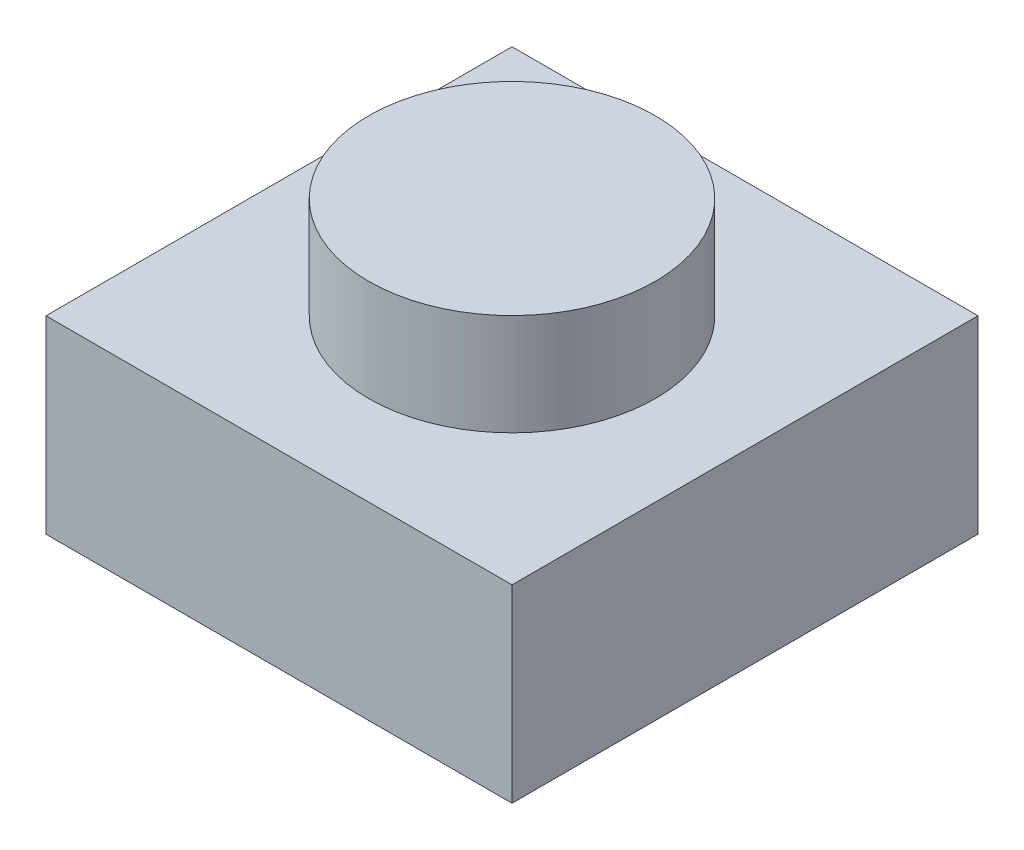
ISO-10303-21;
HEADER;
FILE_DESCRIPTION(('STEP AP214'),'2;1');
FILE_NAME('part.step','',(''),(''),'','','');
FILE_SCHEMA(('AUTOMOTIVE_DESIGN { 1 0 10303 214 1 1 1 1 }'));
ENDSEC;
DATA;
#1=APPLICATION_CONTEXT('core data for automotive mechanical design processes');
#2=APPLICATION_PROTOCOL_DEFINITION('international standard','automotive_design',2000,#1);
#3=PRODUCT_CONTEXT('',#1,'mechanical');
#4=PRODUCT('Part','Part','',(#3));
#5=PRODUCT_RELATED_PRODUCT_CATEGORY('part','',(#4));
#6=PRODUCT_DEFINITION_FORMATION('','',#4);
#7=PRODUCT_DEFINITION_CONTEXT('part definition',#1,'design');
#8=PRODUCT_DEFINITION('design','',#6,#7);
#9=PRODUCT_DEFINITION_SHAPE('','',#8);
#10=(LENGTH_UNIT() NAMED_UNIT(*) SI_UNIT(.MILLI.,.METRE.));
#11=(NAMED_UNIT(*) PLANE_ANGLE_UNIT() SI_UNIT($,.RADIAN.));
#12=(NAMED_UNIT(*) SI_UNIT($,.STERADIAN.) SOLID_ANGLE_UNIT());
#13=UNCERTAINTY_MEASURE_WITH_UNIT(LENGTH_MEASURE(1.E-05),#10,'distance_accuracy_value','');
#14=(GEOMETRIC_REPRESENTATION_CONTEXT(3) GLOBAL_UNCERTAINTY_ASSIGNED_CONTEXT((#13)) GLOBAL_UNIT_ASSIGNED_CONTEXT((#10,
#11,#12)) REPRESENTATION_CONTEXT('',''));
#15=CARTESIAN_POINT('',(0.,0.,0.));
#16=DIRECTION('',(0.,0.,1.));
#17=DIRECTION('',(1.,0.,0.));
#18=AXIS2_PLACEMENT_3D('',#15,#16,#17);
#19=CARTESIAN_POINT('',(-3.9,3.166,-3.9));
#20=DIRECTION('',(0.,1.,0.));
#21=DIRECTION('',(0.,0.,1.));
#22=AXIS2_PLACEMENT_3D('',#19,#20,#21);
#23=PLANE('',#22);
#24=DIRECTION('',(0.,0.,1.));
#25=VECTOR('',#24,1.);
#26=CARTESIAN_POINT('',(-3.9,3.166,3.9));
#27=LINE('',#26,#25);
#28=CARTESIAN_POINT('',(-3.9,3.166,-3.9));
#29=VERTEX_POINT('',#28);
#30=CARTESIAN_POINT('',(-3.9,3.166,3.9));
#31=VERTEX_POINT('',#30);
#32=EDGE_CURVE('E156',#29,#31,#27,.T.);
#33=ORIENTED_EDGE('',*,*,#32,.T.);
#34=DIRECTION('',(1.,0.,0.));
#35=VECTOR('',#34,1.);
#36=CARTESIAN_POINT('',(3.9,3.166,3.9));
#37=LINE('',#36,#35);
#38=CARTESIAN_POINT('',(3.9,3.166,3.9));
#39=VERTEX_POINT('',#38);
#40=EDGE_CURVE('E89',#31,#39,#37,.T.);
#41=ORIENTED_EDGE('',*,*,#40,.T.);
#42=DIRECTION('',(0.,0.,-1.));
#43=VECTOR('',#42,1.);
#44=CARTESIAN_POINT('',(3.9,3.166,3.9));
#45=LINE('',#44,#43);
#46=CARTESIAN_POINT('',(3.9,3.166,-3.9));
#47=VERTEX_POINT('',#46);
#48=EDGE_CURVE('E159',#39,#47,#45,.T.);
#49=ORIENTED_EDGE('',*,*,#48,.T.);
#50=DIRECTION('',(-1.,0.,0.));
#51=VECTOR('',#50,1.);
#52=CARTESIAN_POINT('',(3.9,3.166,-3.9));
#53=LINE('',#52,#51);
#54=EDGE_CURVE('E61',#47,#29,#53,.T.);
#55=ORIENTED_EDGE('',*,*,#54,.T.);
#56=EDGE_LOOP('',(#33,#41,#49,#55));
#57=FACE_BOUND('',#56,.T.);
#58=CARTESIAN_POINT('',(0.,3.166,0.));
#59=DIRECTION('',(0.,1.,0.));
#60=DIRECTION('',(0.,0.,1.));
#61=AXIS2_PLACEMENT_3D('',#58,#59,#60);
#62=CIRCLE('',#61,2.4);
#63=CARTESIAN_POINT('',(0.,3.166,2.4));
#64=VERTEX_POINT('',#63);
#65=EDGE_CURVE('E146',#64,#64,#62,.T.);
#66=ORIENTED_EDGE('',*,*,#65,.F.);
#67=EDGE_LOOP('',(#66));
#68=FACE_BOUND('',#67,.T.);
#69=ADVANCED_FACE('F37',(#57,#68),#23,.T.);
#70=CARTESIAN_POINT('',(-3.9,3.166,3.9));
#71=DIRECTION('',(1.,0.,0.));
#72=DIRECTION('',(0.,0.,-1.));
#73=AXIS2_PLACEMENT_3D('',#70,#71,#72);
#74=PLANE('',#73);
#75=DIRECTION('',(0.,0.,1.));
#76=VECTOR('',#75,1.);
#77=CARTESIAN_POINT('',(-3.9,0.,3.9));
#78=LINE('',#77,#76);
#79=CARTESIAN_POINT('',(-3.9,0.,-3.9));
#80=VERTEX_POINT('',#79);
#81=CARTESIAN_POINT('',(-3.9,0.,3.9));
#82=VERTEX_POINT('',#81);
#83=EDGE_CURVE('E153',#80,#82,#78,.T.);
#84=ORIENTED_EDGE('',*,*,#83,.T.);
#85=DIRECTION('',(0.,-1.,0.));
#86=VECTOR('',#85,1.);
#87=CARTESIAN_POINT('',(-3.9,3.166,3.9));
#88=LINE('',#87,#86);
#89=EDGE_CURVE('E11',#31,#82,#88,.T.);
#90=ORIENTED_EDGE('',*,*,#89,.F.);
#91=ORIENTED_EDGE('',*,*,#32,.F.);
#92=DIRECTION('',(0.,-1.,0.));
#93=VECTOR('',#92,1.);
#94=CARTESIAN_POINT('',(-3.9,3.166,-3.9));
#95=LINE('',#94,#93);
#96=EDGE_CURVE('E162',#29,#80,#95,.T.);
#97=ORIENTED_EDGE('',*,*,#96,.T.);
#98=EDGE_LOOP('',(#84,#90,#91,#97));
#99=FACE_BOUND('',#98,.T.);
#100=ADVANCED_FACE('F39',(#99),#74,.F.);
#101=CARTESIAN_POINT('',(3.9,3.166,3.9));
#102=DIRECTION('',(0.,0.,-1.));
#103=DIRECTION('',(-1.,0.,0.));
#104=AXIS2_PLACEMENT_3D('',#101,#102,#103);
#105=PLANE('',#104);
#106=DIRECTION('',(1.,0.,0.));
#107=VECTOR('',#106,1.);
#108=CARTESIAN_POINT('',(3.9,0.,3.9));
#109=LINE('',#108,#107);
#110=CARTESIAN_POINT('',(3.9,0.,3.9));
#111=VERTEX_POINT('',#110);
#112=EDGE_CURVE('E165',#82,#111,#109,.T.);
#113=ORIENTED_EDGE('',*,*,#112,.T.);
#114=DIRECTION('',(0.,-1.,0.));
#115=VECTOR('',#114,1.);
#116=CARTESIAN_POINT('',(3.9,3.166,3.9));
#117=LINE('',#116,#115);
#118=EDGE_CURVE('E45',#39,#111,#117,.T.);
#119=ORIENTED_EDGE('',*,*,#118,.F.);
#120=ORIENTED_EDGE('',*,*,#40,.F.);
#121=ORIENTED_EDGE('',*,*,#89,.T.);
#122=EDGE_LOOP('',(#113,#119,#120,#121));
#123=FACE_BOUND('',#122,.T.);
#124=ADVANCED_FACE('F194',(#123),#105,.F.);
#125=CARTESIAN_POINT('',(3.9,3.166,3.9));
#126=DIRECTION('',(-1.,0.,0.));
#127=DIRECTION('',(0.,0.,1.));
#128=AXIS2_PLACEMENT_3D('',#125,#126,#127);
#129=PLANE('',#128);
#130=DIRECTION('',(0.,0.,-1.));
#131=VECTOR('',#130,1.);
#132=CARTESIAN_POINT('',(3.9,0.,3.9));
#133=LINE('',#132,#131);
#134=CARTESIAN_POINT('',(3.9,0.,-3.9));
#135=VERTEX_POINT('',#134);
#136=EDGE_CURVE('E167',#111,#135,#133,.T.);
#137=ORIENTED_EDGE('',*,*,#136,.T.);
#138=DIRECTION('',(0.,-1.,0.));
#139=VECTOR('',#138,1.);
#140=CARTESIAN_POINT('',(3.9,3.166,-3.9));
#141=LINE('',#140,#139);
#142=EDGE_CURVE('E171',#47,#135,#141,.T.);
#143=ORIENTED_EDGE('',*,*,#142,.F.);
#144=ORIENTED_EDGE('',*,*,#48,.F.);
#145=ORIENTED_EDGE('',*,*,#118,.T.);
#146=EDGE_LOOP('',(#137,#143,#144,#145));
#147=FACE_BOUND('',#146,.T.);
#148=ADVANCED_FACE('F176',(#147),#129,.F.);
#149=CARTESIAN_POINT('',(3.9,3.166,-3.9));
#150=DIRECTION('',(0.,0.,1.));
#151=DIRECTION('',(1.,0.,0.));
#152=AXIS2_PLACEMENT_3D('',#149,#150,#151);
#153=PLANE('',#152);
#154=DIRECTION('',(-1.,0.,0.));
#155=VECTOR('',#154,1.);
#156=CARTESIAN_POINT('',(3.9,0.,-3.9));
#157=LINE('',#156,#155);
#158=EDGE_CURVE('E82',#135,#80,#157,.T.);
#159=ORIENTED_EDGE('',*,*,#158,.T.);
#160=ORIENTED_EDGE('',*,*,#96,.F.);
#161=ORIENTED_EDGE('',*,*,#54,.F.);
#162=ORIENTED_EDGE('',*,*,#142,.T.);
#163=EDGE_LOOP('',(#159,#160,#161,#162));
#164=FACE_BOUND('',#163,.T.);
#165=ADVANCED_FACE('F184',(#164),#153,.F.);
#166=CARTESIAN_POINT('',(-3.9,0.,-3.9));
#167=DIRECTION('',(0.,1.,0.));
#168=DIRECTION('',(0.,0.,1.));
#169=AXIS2_PLACEMENT_3D('',#166,#167,#168);
#170=PLANE('',#169);
#171=DIRECTION('',(1.,0.,0.));
#172=VECTOR('',#171,1.);
#173=CARTESIAN_POINT('',(2.45,0.,-2.45));
#174=LINE('',#173,#172);
#175=CARTESIAN_POINT('',(-2.45,0.,-2.45));
#176=VERTEX_POINT('',#175);
#177=CARTESIAN_POINT('',(2.45,0.,-2.45));
#178=VERTEX_POINT('',#177);
#179=EDGE_CURVE('E140',#176,#178,#174,.T.);
#180=ORIENTED_EDGE('',*,*,#179,.F.);
#181=DIRECTION('',(0.,0.,-1.));
#182=VECTOR('',#181,1.);
#183=CARTESIAN_POINT('',(-2.45,0.,-2.45));
#184=LINE('',#183,#182);
#185=CARTESIAN_POINT('',(-2.45,0.,2.45));
#186=VERTEX_POINT('',#185);
#187=EDGE_CURVE('E52',#186,#176,#184,.T.);
#188=ORIENTED_EDGE('',*,*,#187,.F.);
#189=DIRECTION('',(-1.,0.,0.));
#190=VECTOR('',#189,1.);
#191=CARTESIAN_POINT('',(2.45,0.,2.45));
#192=LINE('',#191,#190);
#193=CARTESIAN_POINT('',(2.45,0.,2.45));
#194=VERTEX_POINT('',#193);
#195=EDGE_CURVE('E131',#194,#186,#192,.T.);
#196=ORIENTED_EDGE('',*,*,#195,.F.);
#197=DIRECTION('',(0.,0.,1.));
#198=VECTOR('',#197,1.);
#199=CARTESIAN_POINT('',(2.45,0.,-2.45));
#200=LINE('',#199,#198);
#201=EDGE_CURVE('E134',#178,#194,#200,.T.);
#202=ORIENTED_EDGE('',*,*,#201,.F.);
#203=EDGE_LOOP('',(#180,#188,#196,#202));
#204=FACE_BOUND('',#203,.T.);
#205=ORIENTED_EDGE('',*,*,#83,.F.);
#206=ORIENTED_EDGE('',*,*,#158,.F.);
#207=ORIENTED_EDGE('',*,*,#136,.F.);
#208=ORIENTED_EDGE('',*,*,#112,.F.);
#209=EDGE_LOOP('',(#205,#206,#207,#208));
#210=FACE_BOUND('',#209,.T.);
#211=ADVANCED_FACE('F180',(#204,#210),#170,.F.);
#212=CARTESIAN_POINT('',(0.,4.866,0.));
#213=DIRECTION('',(0.,-1.,0.));
#214=DIRECTION('',(0.,0.,-1.));
#215=AXIS2_PLACEMENT_3D('',#212,#213,#214);
#216=CYLINDRICAL_SURFACE('',#215,2.4);
#217=CARTESIAN_POINT('',(0.,4.866,0.));
#218=DIRECTION('',(0.,1.,0.));
#219=DIRECTION('',(0.,0.,1.));
#220=AXIS2_PLACEMENT_3D('',#217,#218,#219);
#221=CIRCLE('',#220,2.4);
#222=CARTESIAN_POINT('',(0.,4.866,2.4));
#223=VERTEX_POINT('',#222);
#224=EDGE_CURVE('E150',#223,#223,#221,.T.);
#225=ORIENTED_EDGE('',*,*,#224,.F.);
#226=EDGE_LOOP('',(#225));
#227=FACE_BOUND('',#226,.T.);
#228=ORIENTED_EDGE('',*,*,#65,.T.);
#229=EDGE_LOOP('',(#228));
#230=FACE_BOUND('',#229,.T.);
#231=ADVANCED_FACE('F191',(#227,#230),#216,.T.);
#232=CARTESIAN_POINT('',(0.,4.866,0.));
#233=DIRECTION('',(0.,1.,0.));
#234=DIRECTION('',(0.,0.,1.));
#235=AXIS2_PLACEMENT_3D('',#232,#233,#234);
#236=PLANE('',#235);
#237=ORIENTED_EDGE('',*,*,#224,.T.);
#238=EDGE_LOOP('',(#237));
#239=FACE_BOUND('',#238,.T.);
#240=ADVANCED_FACE('F205',(#239),#236,.T.);
#241=CARTESIAN_POINT('',(-2.45,2.5,-2.45));
#242=DIRECTION('',(-1.,0.,0.));
#243=DIRECTION('',(0.,0.,1.));
#244=AXIS2_PLACEMENT_3D('',#241,#242,#243);
#245=PLANE('',#244);
#246=ORIENTED_EDGE('',*,*,#187,.T.);
#247=DIRECTION('',(0.,-1.,0.));
#248=VECTOR('',#247,1.);
#249=CARTESIAN_POINT('',(-2.45,2.5,-2.45));
#250=LINE('',#249,#248);
#251=CARTESIAN_POINT('',(-2.45,2.5,-2.45));
#252=VERTEX_POINT('',#251);
#253=EDGE_CURVE('E109',#252,#176,#250,.T.);
#254=ORIENTED_EDGE('',*,*,#253,.F.);
#255=DIRECTION('',(0.,0.,-1.));
#256=VECTOR('',#255,1.);
#257=CARTESIAN_POINT('',(-2.45,2.5,-2.45));
#258=LINE('',#257,#256);
#259=CARTESIAN_POINT('',(-2.45,2.5,2.45));
#260=VERTEX_POINT('',#259);
#261=EDGE_CURVE('E113',#260,#252,#258,.T.);
#262=ORIENTED_EDGE('',*,*,#261,.F.);
#263=DIRECTION('',(0.,-1.,0.));
#264=VECTOR('',#263,1.);
#265=CARTESIAN_POINT('',(-2.45,2.5,2.45));
#266=LINE('',#265,#264);
#267=EDGE_CURVE('E144',#260,#186,#266,.T.);
#268=ORIENTED_EDGE('',*,*,#267,.T.);
#269=EDGE_LOOP('',(#246,#254,#262,#268));
#270=FACE_BOUND('',#269,.T.);
#271=ADVANCED_FACE('F111',(#270),#245,.F.);
#272=CARTESIAN_POINT('',(2.45,2.5,2.45));
#273=DIRECTION('',(0.,0.,1.));
#274=DIRECTION('',(1.,0.,0.));
#275=AXIS2_PLACEMENT_3D('',#272,#273,#274);
#276=PLANE('',#275);
#277=ORIENTED_EDGE('',*,*,#195,.T.);
#278=ORIENTED_EDGE('',*,*,#267,.F.);
#279=DIRECTION('',(-1.,0.,0.));
#280=VECTOR('',#279,1.);
#281=CARTESIAN_POINT('',(2.45,2.5,2.45));
#282=LINE('',#281,#280);
#283=CARTESIAN_POINT('',(2.45,2.5,2.45));
#284=VERTEX_POINT('',#283);
#285=EDGE_CURVE('E119',#284,#260,#282,.T.);
#286=ORIENTED_EDGE('',*,*,#285,.F.);
#287=DIRECTION('',(0.,-1.,0.));
#288=VECTOR('',#287,1.);
#289=CARTESIAN_POINT('',(2.45,2.5,2.45));
#290=LINE('',#289,#288);
#291=EDGE_CURVE('E147',#284,#194,#290,.T.);
#292=ORIENTED_EDGE('',*,*,#291,.T.);
#293=EDGE_LOOP('',(#277,#278,#286,#292));
#294=FACE_BOUND('',#293,.T.);
#295=ADVANCED_FACE('F212',(#294),#276,.F.);
#296=CARTESIAN_POINT('',(2.45,2.5,-2.45));
#297=DIRECTION('',(1.,0.,0.));
#298=DIRECTION('',(0.,0.,-1.));
#299=AXIS2_PLACEMENT_3D('',#296,#297,#298);
#300=PLANE('',#299);
#301=ORIENTED_EDGE('',*,*,#201,.T.);
#302=ORIENTED_EDGE('',*,*,#291,.F.);
#303=DIRECTION('',(0.,0.,1.));
#304=VECTOR('',#303,1.);
#305=CARTESIAN_POINT('',(2.45,2.5,-2.45));
#306=LINE('',#305,#304);
#307=CARTESIAN_POINT('',(2.45,2.5,-2.45));
#308=VERTEX_POINT('',#307);
#309=EDGE_CURVE('E127',#308,#284,#306,.T.);
#310=ORIENTED_EDGE('',*,*,#309,.F.);
#311=DIRECTION('',(0.,-1.,0.));
#312=VECTOR('',#311,1.);
#313=CARTESIAN_POINT('',(2.45,2.5,-2.45));
#314=LINE('',#313,#312);
#315=EDGE_CURVE('E118',#308,#178,#314,.T.);
#316=ORIENTED_EDGE('',*,*,#315,.T.);
#317=EDGE_LOOP('',(#301,#302,#310,#316));
#318=FACE_BOUND('',#317,.T.);
#319=ADVANCED_FACE('F215',(#318),#300,.F.);
#320=CARTESIAN_POINT('',(2.45,2.5,-2.45));
#321=DIRECTION('',(0.,0.,-1.));
#322=DIRECTION('',(-1.,0.,0.));
#323=AXIS2_PLACEMENT_3D('',#320,#321,#322);
#324=PLANE('',#323);
#325=ORIENTED_EDGE('',*,*,#179,.T.);
#326=ORIENTED_EDGE('',*,*,#315,.F.);
#327=DIRECTION('',(1.,0.,0.));
#328=VECTOR('',#327,1.);
#329=CARTESIAN_POINT('',(2.45,2.5,-2.45));
#330=LINE('',#329,#328);
#331=EDGE_CURVE('E122',#252,#308,#330,.T.);
#332=ORIENTED_EDGE('',*,*,#331,.F.);
#333=ORIENTED_EDGE('',*,*,#253,.T.);
#334=EDGE_LOOP('',(#325,#326,#332,#333));
#335=FACE_BOUND('',#334,.T.);
#336=ADVANCED_FACE('F123',(#335),#324,.F.);
#337=CARTESIAN_POINT('',(-2.45,2.5,2.45));
#338=DIRECTION('',(0.,-1.,0.));
#339=DIRECTION('',(0.,0.,-1.));
#340=AXIS2_PLACEMENT_3D('',#337,#338,#339);
#341=PLANE('',#340);
#342=ORIENTED_EDGE('',*,*,#261,.T.);
#343=ORIENTED_EDGE('',*,*,#331,.T.);
#344=ORIENTED_EDGE('',*,*,#309,.T.);
#345=ORIENTED_EDGE('',*,*,#285,.T.);
#346=EDGE_LOOP('',(#342,#343,#344,#345));
#347=FACE_BOUND('',#346,.T.);
#348=ADVANCED_FACE('F129',(#347),#341,.T.);
#349=CLOSED_SHELL('',(#69,#100,#124,#148,#165,#211,#231,#240,#271,#295,#319,#336,#348));
#350=MANIFOLD_SOLID_BREP('B2',#349);
#351=ADVANCED_BREP_SHAPE_REPRESENTATION('',(#18,#350),#14);
#352=SHAPE_DEFINITION_REPRESENTATION(#9,#351);
ENDSEC;
END-ISO-10303-21;
